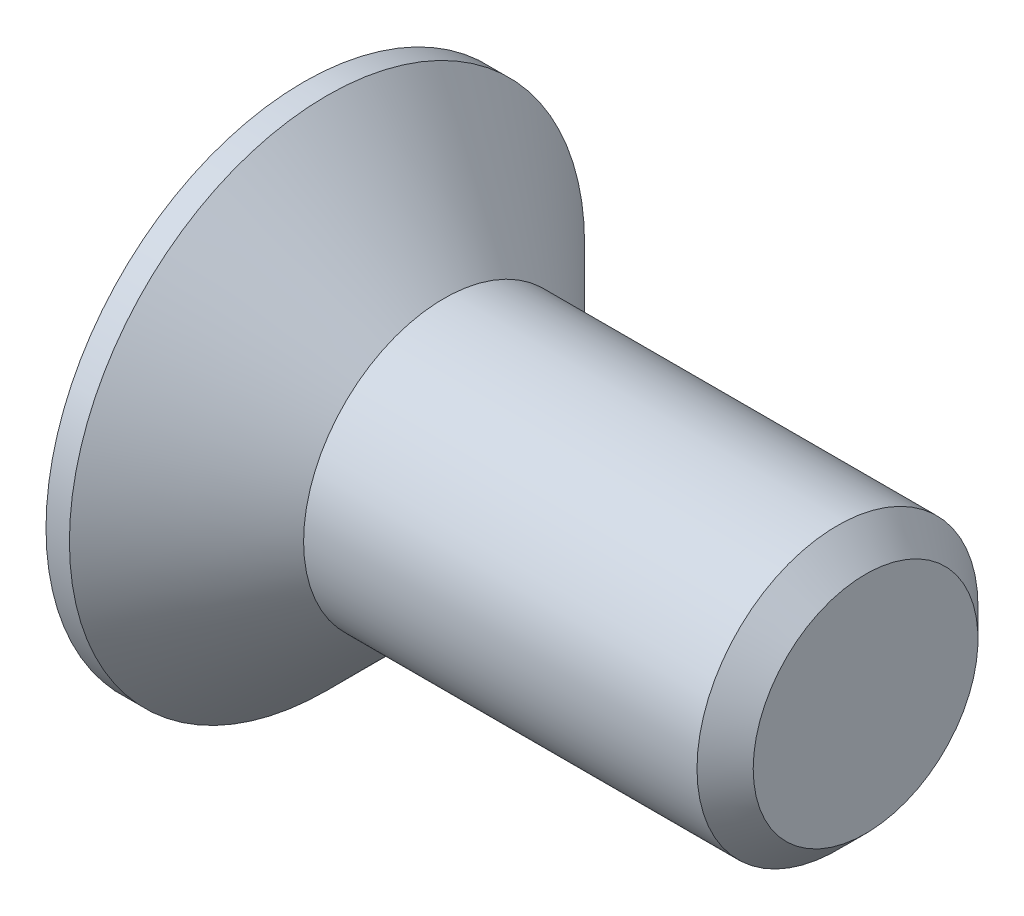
ISO-10303-21;
HEADER;
FILE_DESCRIPTION(('STEP AP214'),'2;1');
FILE_NAME('part.step','',(''),(''),'','','');
FILE_SCHEMA(('AUTOMOTIVE_DESIGN { 1 0 10303 214 1 1 1 1 }'));
ENDSEC;
DATA;
#1=APPLICATION_CONTEXT('core data for automotive mechanical design processes');
#2=APPLICATION_PROTOCOL_DEFINITION('international standard','automotive_design',2000,#1);
#3=PRODUCT_CONTEXT('',#1,'mechanical');
#4=PRODUCT('Part','Part','',(#3));
#5=PRODUCT_RELATED_PRODUCT_CATEGORY('part','',(#4));
#6=PRODUCT_DEFINITION_FORMATION('','',#4);
#7=PRODUCT_DEFINITION_CONTEXT('part definition',#1,'design');
#8=PRODUCT_DEFINITION('design','',#6,#7);
#9=PRODUCT_DEFINITION_SHAPE('','',#8);
#10=(LENGTH_UNIT() NAMED_UNIT(*) SI_UNIT(.MILLI.,.METRE.));
#11=(NAMED_UNIT(*) PLANE_ANGLE_UNIT() SI_UNIT($,.RADIAN.));
#12=(NAMED_UNIT(*) SI_UNIT($,.STERADIAN.) SOLID_ANGLE_UNIT());
#13=UNCERTAINTY_MEASURE_WITH_UNIT(LENGTH_MEASURE(1.E-05),#10,'distance_accuracy_value','');
#14=(GEOMETRIC_REPRESENTATION_CONTEXT(3) GLOBAL_UNCERTAINTY_ASSIGNED_CONTEXT((#13)) GLOBAL_UNIT_ASSIGNED_CONTEXT((#10,
#11,#12)) REPRESENTATION_CONTEXT('',''));
#15=CARTESIAN_POINT('',(0.,0.,0.));
#16=DIRECTION('',(0.,0.,1.));
#17=DIRECTION('',(1.,0.,0.));
#18=AXIS2_PLACEMENT_3D('',#15,#16,#17);
#19=CARTESIAN_POINT('',(0.,0.,0.));
#20=DIRECTION('',(-1.,0.,0.));
#21=DIRECTION('',(0.,0.,1.));
#22=AXIS2_PLACEMENT_3D('',#19,#20,#21);
#23=CONICAL_SURFACE('',#22,3.,0.78539816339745);
#24=CARTESIAN_POINT('',(-2.49999999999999,0.,0.));
#25=DIRECTION('',(-1.,0.,0.));
#26=DIRECTION('',(0.,0.,1.));
#27=AXIS2_PLACEMENT_3D('',#24,#25,#26);
#28=CIRCLE('',#27,5.5);
#29=CARTESIAN_POINT('',(-2.49999999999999,0.,5.5));
#30=VERTEX_POINT('',#29);
#31=EDGE_CURVE('E189',#30,#30,#28,.T.);
#32=ORIENTED_EDGE('',*,*,#31,.F.);
#33=EDGE_LOOP('',(#32));
#34=FACE_BOUND('',#33,.T.);
#35=CARTESIAN_POINT('',(0.,0.,0.));
#36=DIRECTION('',(-1.,0.,0.));
#37=DIRECTION('',(0.,0.,1.));
#38=AXIS2_PLACEMENT_3D('',#35,#36,#37);
#39=CIRCLE('',#38,3.);
#40=CARTESIAN_POINT('',(0.,0.,3.));
#41=VERTEX_POINT('',#40);
#42=EDGE_CURVE('E212',#41,#41,#39,.T.);
#43=ORIENTED_EDGE('',*,*,#42,.T.);
#44=EDGE_LOOP('',(#43));
#45=FACE_BOUND('',#44,.T.);
#46=ADVANCED_FACE('F33',(#34,#45),#23,.T.);
#47=CARTESIAN_POINT('',(-3.,0.,0.));
#48=DIRECTION('',(-1.,0.,0.));
#49=DIRECTION('',(0.,0.,1.));
#50=AXIS2_PLACEMENT_3D('',#47,#48,#49);
#51=CYLINDRICAL_SURFACE('',#50,3.);
#52=CARTESIAN_POINT('',(8.4,0.,0.));
#53=DIRECTION('',(-1.,0.,0.));
#54=DIRECTION('',(0.,0.,1.));
#55=AXIS2_PLACEMENT_3D('',#52,#53,#54);
#56=CIRCLE('',#55,3.);
#57=CARTESIAN_POINT('',(8.4,0.,3.));
#58=VERTEX_POINT('',#57);
#59=EDGE_CURVE('E41',#58,#58,#56,.T.);
#60=ORIENTED_EDGE('',*,*,#59,.T.);
#61=EDGE_LOOP('',(#60));
#62=FACE_BOUND('',#61,.T.);
#63=ORIENTED_EDGE('',*,*,#42,.F.);
#64=EDGE_LOOP('',(#63));
#65=FACE_BOUND('',#64,.T.);
#66=ADVANCED_FACE('F217',(#62,#65),#51,.T.);
#67=CARTESIAN_POINT('',(9.,0.,0.));
#68=DIRECTION('',(-1.,0.,0.));
#69=DIRECTION('',(0.,0.,1.));
#70=AXIS2_PLACEMENT_3D('',#67,#68,#69);
#71=PLANE('',#70);
#72=CARTESIAN_POINT('',(9.,0.,0.));
#73=DIRECTION('',(-1.,0.,0.));
#74=DIRECTION('',(0.,0.,1.));
#75=AXIS2_PLACEMENT_3D('',#72,#73,#74);
#76=CIRCLE('',#75,2.4);
#77=CARTESIAN_POINT('',(9.,0.,2.4));
#78=VERTEX_POINT('',#77);
#79=EDGE_CURVE('E11',#78,#78,#76,.F.);
#80=ORIENTED_EDGE('',*,*,#79,.T.);
#81=EDGE_LOOP('',(#80));
#82=FACE_BOUND('',#81,.T.);
#83=ADVANCED_FACE('F239',(#82),#71,.F.);
#84=CARTESIAN_POINT('',(-3.,5.5,0.));
#85=DIRECTION('',(1.,0.,0.));
#86=DIRECTION('',(0.,0.,-1.));
#87=AXIS2_PLACEMENT_3D('',#84,#85,#86);
#88=PLANE('',#87);
#89=DIRECTION('',(0.,0.,-1.));
#90=VECTOR('',#89,1.);
#91=CARTESIAN_POINT('',(-3.,0.825,-3.3));
#92=LINE('',#91,#90);
#93=CARTESIAN_POINT('',(-3.,0.825,-0.825));
#94=VERTEX_POINT('',#93);
#95=CARTESIAN_POINT('',(-3.,0.825,-3.3));
#96=VERTEX_POINT('',#95);
#97=EDGE_CURVE('E158',#94,#96,#92,.T.);
#98=ORIENTED_EDGE('',*,*,#97,.F.);
#99=DIRECTION('',(0.,-1.,0.));
#100=VECTOR('',#99,1.);
#101=CARTESIAN_POINT('',(-3.,0.825,-0.825));
#102=LINE('',#101,#100);
#103=CARTESIAN_POINT('',(-3.,3.3,-0.825));
#104=VERTEX_POINT('',#103);
#105=EDGE_CURVE('E48',#104,#94,#102,.T.);
#106=ORIENTED_EDGE('',*,*,#105,.F.);
#107=DIRECTION('',(0.,0.,-1.));
#108=VECTOR('',#107,1.);
#109=CARTESIAN_POINT('',(-3.,3.3,-0.825));
#110=LINE('',#109,#108);
#111=CARTESIAN_POINT('',(-3.,3.3,0.825));
#112=VERTEX_POINT('',#111);
#113=EDGE_CURVE('E185',#112,#104,#110,.T.);
#114=ORIENTED_EDGE('',*,*,#113,.F.);
#115=DIRECTION('',(0.,1.,0.));
#116=VECTOR('',#115,1.);
#117=CARTESIAN_POINT('',(-3.,3.3,0.825));
#118=LINE('',#117,#116);
#119=CARTESIAN_POINT('',(-3.,0.825,0.825));
#120=VERTEX_POINT('',#119);
#121=EDGE_CURVE('E183',#120,#112,#118,.T.);
#122=ORIENTED_EDGE('',*,*,#121,.F.);
#123=DIRECTION('',(0.,0.,-1.));
#124=VECTOR('',#123,1.);
#125=CARTESIAN_POINT('',(-3.,0.825,0.825));
#126=LINE('',#125,#124);
#127=CARTESIAN_POINT('',(-3.,0.825,3.3));
#128=VERTEX_POINT('',#127);
#129=EDGE_CURVE('E132',#128,#120,#126,.T.);
#130=ORIENTED_EDGE('',*,*,#129,.F.);
#131=DIRECTION('',(0.,1.,0.));
#132=VECTOR('',#131,1.);
#133=CARTESIAN_POINT('',(-3.,0.825,3.3));
#134=LINE('',#133,#132);
#135=CARTESIAN_POINT('',(-3.,-0.825,3.3));
#136=VERTEX_POINT('',#135);
#137=EDGE_CURVE('E179',#136,#128,#134,.T.);
#138=ORIENTED_EDGE('',*,*,#137,.F.);
#139=DIRECTION('',(0.,0.,1.));
#140=VECTOR('',#139,1.);
#141=CARTESIAN_POINT('',(-3.,-0.825,3.3));
#142=LINE('',#141,#140);
#143=CARTESIAN_POINT('',(-3.,-0.825,0.825));
#144=VERTEX_POINT('',#143);
#145=EDGE_CURVE('E176',#144,#136,#142,.T.);
#146=ORIENTED_EDGE('',*,*,#145,.F.);
#147=DIRECTION('',(0.,1.,0.));
#148=VECTOR('',#147,1.);
#149=CARTESIAN_POINT('',(-3.,-0.825,0.825));
#150=LINE('',#149,#148);
#151=CARTESIAN_POINT('',(-3.,-3.3,0.825));
#152=VERTEX_POINT('',#151);
#153=EDGE_CURVE('E173',#152,#144,#150,.T.);
#154=ORIENTED_EDGE('',*,*,#153,.F.);
#155=DIRECTION('',(0.,0.,1.));
#156=VECTOR('',#155,1.);
#157=CARTESIAN_POINT('',(-3.,-3.3,0.825));
#158=LINE('',#157,#156);
#159=CARTESIAN_POINT('',(-3.,-3.3,-0.825));
#160=VERTEX_POINT('',#159);
#161=EDGE_CURVE('E170',#160,#152,#158,.T.);
#162=ORIENTED_EDGE('',*,*,#161,.F.);
#163=DIRECTION('',(0.,-1.,0.));
#164=VECTOR('',#163,1.);
#165=CARTESIAN_POINT('',(-3.,-3.3,-0.825));
#166=LINE('',#165,#164);
#167=CARTESIAN_POINT('',(-3.,-0.825,-0.825));
#168=VERTEX_POINT('',#167);
#169=EDGE_CURVE('E167',#168,#160,#166,.T.);
#170=ORIENTED_EDGE('',*,*,#169,.F.);
#171=DIRECTION('',(0.,0.,1.));
#172=VECTOR('',#171,1.);
#173=CARTESIAN_POINT('',(-3.,-0.825,-0.825));
#174=LINE('',#173,#172);
#175=CARTESIAN_POINT('',(-3.,-0.825,-3.3));
#176=VERTEX_POINT('',#175);
#177=EDGE_CURVE('E164',#176,#168,#174,.T.);
#178=ORIENTED_EDGE('',*,*,#177,.F.);
#179=DIRECTION('',(0.,-1.,0.));
#180=VECTOR('',#179,1.);
#181=CARTESIAN_POINT('',(-3.,-0.825,-3.3));
#182=LINE('',#181,#180);
#183=EDGE_CURVE('E161',#96,#176,#182,.T.);
#184=ORIENTED_EDGE('',*,*,#183,.F.);
#185=EDGE_LOOP('',(#98,#106,#114,#122,#130,#138,#146,#154,#162,#170,#178,#184));
#186=FACE_BOUND('',#185,.T.);
#187=CARTESIAN_POINT('',(-3.,0.,0.));
#188=DIRECTION('',(-1.,0.,0.));
#189=DIRECTION('',(0.,0.,1.));
#190=AXIS2_PLACEMENT_3D('',#187,#188,#189);
#191=CIRCLE('',#190,5.5);
#192=CARTESIAN_POINT('',(-3.,0.,5.5));
#193=VERTEX_POINT('',#192);
#194=EDGE_CURVE('E209',#193,#193,#191,.T.);
#195=ORIENTED_EDGE('',*,*,#194,.T.);
#196=EDGE_LOOP('',(#195));
#197=FACE_BOUND('',#196,.T.);
#198=ADVANCED_FACE('F230',(#186,#197),#88,.F.);
#199=CARTESIAN_POINT('',(-3.,0.,0.));
#200=DIRECTION('',(-1.,0.,0.));
#201=DIRECTION('',(0.,0.,1.));
#202=AXIS2_PLACEMENT_3D('',#199,#200,#201);
#203=CYLINDRICAL_SURFACE('',#202,5.5);
#204=ORIENTED_EDGE('',*,*,#194,.F.);
#205=EDGE_LOOP('',(#204));
#206=FACE_BOUND('',#205,.T.);
#207=ORIENTED_EDGE('',*,*,#31,.T.);
#208=EDGE_LOOP('',(#207));
#209=FACE_BOUND('',#208,.T.);
#210=ADVANCED_FACE('F222',(#206,#209),#203,.T.);
#211=CARTESIAN_POINT('',(8.4,0.,0.));
#212=DIRECTION('',(-1.,0.,0.));
#213=DIRECTION('',(0.,0.,1.));
#214=AXIS2_PLACEMENT_3D('',#211,#212,#213);
#215=CONICAL_SURFACE('',#214,3.,0.78539816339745);
#216=ORIENTED_EDGE('',*,*,#79,.F.);
#217=EDGE_LOOP('',(#216));
#218=FACE_BOUND('',#217,.T.);
#219=ORIENTED_EDGE('',*,*,#59,.F.);
#220=EDGE_LOOP('',(#219));
#221=FACE_BOUND('',#220,.T.);
#222=ADVANCED_FACE('F35',(#218,#221),#215,.T.);
#223=CARTESIAN_POINT('',(-0.5,0.825,-0.825));
#224=DIRECTION('',(0.,0.,-1.));
#225=DIRECTION('',(-1.,0.,0.));
#226=AXIS2_PLACEMENT_3D('',#223,#224,#225);
#227=PLANE('',#226);
#228=ORIENTED_EDGE('',*,*,#105,.T.);
#229=DIRECTION('',(-1.,0.,0.));
#230=VECTOR('',#229,1.);
#231=CARTESIAN_POINT('',(-0.5,0.825,-0.825));
#232=LINE('',#231,#230);
#233=CARTESIAN_POINT('',(-0.5,0.825,-0.825));
#234=VERTEX_POINT('',#233);
#235=EDGE_CURVE('E96',#234,#94,#232,.T.);
#236=ORIENTED_EDGE('',*,*,#235,.F.);
#237=DIRECTION('',(0.,-1.,0.));
#238=VECTOR('',#237,1.);
#239=CARTESIAN_POINT('',(-0.5,0.825,-0.825));
#240=LINE('',#239,#238);
#241=CARTESIAN_POINT('',(-0.5,3.3,-0.825));
#242=VERTEX_POINT('',#241);
#243=EDGE_CURVE('E187',#242,#234,#240,.T.);
#244=ORIENTED_EDGE('',*,*,#243,.F.);
#245=DIRECTION('',(-1.,0.,0.));
#246=VECTOR('',#245,1.);
#247=CARTESIAN_POINT('',(-0.5,3.3,-0.825));
#248=LINE('',#247,#246);
#249=EDGE_CURVE('E56',#242,#104,#248,.T.);
#250=ORIENTED_EDGE('',*,*,#249,.T.);
#251=EDGE_LOOP('',(#228,#236,#244,#250));
#252=FACE_BOUND('',#251,.T.);
#253=ADVANCED_FACE('F221',(#252),#227,.F.);
#254=CARTESIAN_POINT('',(-0.5,3.3,-0.825));
#255=DIRECTION('',(0.,1.,0.));
#256=DIRECTION('',(-1.,0.,0.));
#257=AXIS2_PLACEMENT_3D('',#254,#255,#256);
#258=PLANE('',#257);
#259=ORIENTED_EDGE('',*,*,#113,.T.);
#260=ORIENTED_EDGE('',*,*,#249,.F.);
#261=DIRECTION('',(0.,0.,-1.));
#262=VECTOR('',#261,1.);
#263=CARTESIAN_POINT('',(-0.5,3.3,-0.825));
#264=LINE('',#263,#262);
#265=CARTESIAN_POINT('',(-0.5,3.3,0.825));
#266=VERTEX_POINT('',#265);
#267=EDGE_CURVE('E144',#266,#242,#264,.T.);
#268=ORIENTED_EDGE('',*,*,#267,.F.);
#269=DIRECTION('',(-1.,0.,0.));
#270=VECTOR('',#269,1.);
#271=CARTESIAN_POINT('',(-0.5,3.3,0.825));
#272=LINE('',#271,#270);
#273=EDGE_CURVE('E136',#266,#112,#272,.T.);
#274=ORIENTED_EDGE('',*,*,#273,.T.);
#275=EDGE_LOOP('',(#259,#260,#268,#274));
#276=FACE_BOUND('',#275,.T.);
#277=ADVANCED_FACE('F228',(#276),#258,.F.);
#278=CARTESIAN_POINT('',(-0.5,3.3,0.825));
#279=DIRECTION('',(0.,0.,1.));
#280=DIRECTION('',(1.,0.,0.));
#281=AXIS2_PLACEMENT_3D('',#278,#279,#280);
#282=PLANE('',#281);
#283=ORIENTED_EDGE('',*,*,#121,.T.);
#284=ORIENTED_EDGE('',*,*,#273,.F.);
#285=DIRECTION('',(0.,1.,0.));
#286=VECTOR('',#285,1.);
#287=CARTESIAN_POINT('',(-0.5,3.3,0.825));
#288=LINE('',#287,#286);
#289=CARTESIAN_POINT('',(-0.5,0.825,0.825));
#290=VERTEX_POINT('',#289);
#291=EDGE_CURVE('E140',#290,#266,#288,.T.);
#292=ORIENTED_EDGE('',*,*,#291,.F.);
#293=DIRECTION('',(-1.,0.,0.));
#294=VECTOR('',#293,1.);
#295=CARTESIAN_POINT('',(-0.5,0.825,0.825));
#296=LINE('',#295,#294);
#297=EDGE_CURVE('E125',#290,#120,#296,.T.);
#298=ORIENTED_EDGE('',*,*,#297,.T.);
#299=EDGE_LOOP('',(#283,#284,#292,#298));
#300=FACE_BOUND('',#299,.T.);
#301=ADVANCED_FACE('F141',(#300),#282,.F.);
#302=CARTESIAN_POINT('',(-0.5,0.825,0.825));
#303=DIRECTION('',(0.,1.,0.));
#304=DIRECTION('',(-1.,0.,0.));
#305=AXIS2_PLACEMENT_3D('',#302,#303,#304);
#306=PLANE('',#305);
#307=ORIENTED_EDGE('',*,*,#129,.T.);
#308=ORIENTED_EDGE('',*,*,#297,.F.);
#309=DIRECTION('',(0.,0.,-1.));
#310=VECTOR('',#309,1.);
#311=CARTESIAN_POINT('',(-0.5,0.825,0.825));
#312=LINE('',#311,#310);
#313=CARTESIAN_POINT('',(-0.5,0.825,3.3));
#314=VERTEX_POINT('',#313);
#315=EDGE_CURVE('E129',#314,#290,#312,.T.);
#316=ORIENTED_EDGE('',*,*,#315,.F.);
#317=DIRECTION('',(-1.,0.,0.));
#318=VECTOR('',#317,1.);
#319=CARTESIAN_POINT('',(-0.5,0.825,3.3));
#320=LINE('',#319,#318);
#321=EDGE_CURVE('E137',#314,#128,#320,.T.);
#322=ORIENTED_EDGE('',*,*,#321,.T.);
#323=EDGE_LOOP('',(#307,#308,#316,#322));
#324=FACE_BOUND('',#323,.T.);
#325=ADVANCED_FACE('F127',(#324),#306,.F.);
#326=CARTESIAN_POINT('',(-0.5,0.825,3.3));
#327=DIRECTION('',(0.,0.,1.));
#328=DIRECTION('',(1.,0.,0.));
#329=AXIS2_PLACEMENT_3D('',#326,#327,#328);
#330=PLANE('',#329);
#331=ORIENTED_EDGE('',*,*,#137,.T.);
#332=ORIENTED_EDGE('',*,*,#321,.F.);
#333=DIRECTION('',(0.,1.,0.));
#334=VECTOR('',#333,1.);
#335=CARTESIAN_POINT('',(-0.5,0.825,3.3));
#336=LINE('',#335,#334);
#337=CARTESIAN_POINT('',(-0.5,-0.825,3.3));
#338=VERTEX_POINT('',#337);
#339=EDGE_CURVE('E150',#338,#314,#336,.T.);
#340=ORIENTED_EDGE('',*,*,#339,.F.);
#341=DIRECTION('',(-1.,0.,0.));
#342=VECTOR('',#341,1.);
#343=CARTESIAN_POINT('',(-0.5,-0.825,3.3));
#344=LINE('',#343,#342);
#345=EDGE_CURVE('E192',#338,#136,#344,.T.);
#346=ORIENTED_EDGE('',*,*,#345,.T.);
#347=EDGE_LOOP('',(#331,#332,#340,#346));
#348=FACE_BOUND('',#347,.T.);
#349=ADVANCED_FACE('F277',(#348),#330,.F.);
#350=CARTESIAN_POINT('',(-0.5,-0.825,3.3));
#351=DIRECTION('',(0.,-1.,0.));
#352=DIRECTION('',(1.,0.,0.));
#353=AXIS2_PLACEMENT_3D('',#350,#351,#352);
#354=PLANE('',#353);
#355=ORIENTED_EDGE('',*,*,#145,.T.);
#356=ORIENTED_EDGE('',*,*,#345,.F.);
#357=DIRECTION('',(0.,0.,1.));
#358=VECTOR('',#357,1.);
#359=CARTESIAN_POINT('',(-0.5,-0.825,3.3));
#360=LINE('',#359,#358);
#361=CARTESIAN_POINT('',(-0.5,-0.825,0.825));
#362=VERTEX_POINT('',#361);
#363=EDGE_CURVE('E152',#362,#338,#360,.T.);
#364=ORIENTED_EDGE('',*,*,#363,.F.);
#365=DIRECTION('',(-1.,0.,0.));
#366=VECTOR('',#365,1.);
#367=CARTESIAN_POINT('',(-0.5,-0.825,0.825));
#368=LINE('',#367,#366);
#369=EDGE_CURVE('E194',#362,#144,#368,.T.);
#370=ORIENTED_EDGE('',*,*,#369,.T.);
#371=EDGE_LOOP('',(#355,#356,#364,#370));
#372=FACE_BOUND('',#371,.T.);
#373=ADVANCED_FACE('F273',(#372),#354,.F.);
#374=CARTESIAN_POINT('',(-0.5,-0.825,0.825));
#375=DIRECTION('',(0.,0.,1.));
#376=DIRECTION('',(1.,0.,0.));
#377=AXIS2_PLACEMENT_3D('',#374,#375,#376);
#378=PLANE('',#377);
#379=ORIENTED_EDGE('',*,*,#153,.T.);
#380=ORIENTED_EDGE('',*,*,#369,.F.);
#381=DIRECTION('',(0.,1.,0.));
#382=VECTOR('',#381,1.);
#383=CARTESIAN_POINT('',(-0.5,-0.825,0.825));
#384=LINE('',#383,#382);
#385=CARTESIAN_POINT('',(-0.5,-3.3,0.825));
#386=VERTEX_POINT('',#385);
#387=EDGE_CURVE('E422',#386,#362,#384,.T.);
#388=ORIENTED_EDGE('',*,*,#387,.F.);
#389=DIRECTION('',(-1.,0.,0.));
#390=VECTOR('',#389,1.);
#391=CARTESIAN_POINT('',(-0.5,-3.3,0.825));
#392=LINE('',#391,#390);
#393=EDGE_CURVE('E196',#386,#152,#392,.T.);
#394=ORIENTED_EDGE('',*,*,#393,.T.);
#395=EDGE_LOOP('',(#379,#380,#388,#394));
#396=FACE_BOUND('',#395,.T.);
#397=ADVANCED_FACE('F269',(#396),#378,.F.);
#398=CARTESIAN_POINT('',(-0.5,-3.3,0.825));
#399=DIRECTION('',(0.,-1.,0.));
#400=DIRECTION('',(1.,0.,0.));
#401=AXIS2_PLACEMENT_3D('',#398,#399,#400);
#402=PLANE('',#401);
#403=ORIENTED_EDGE('',*,*,#161,.T.);
#404=ORIENTED_EDGE('',*,*,#393,.F.);
#405=DIRECTION('',(0.,0.,1.));
#406=VECTOR('',#405,1.);
#407=CARTESIAN_POINT('',(-0.5,-3.3,0.825));
#408=LINE('',#407,#406);
#409=CARTESIAN_POINT('',(-0.5,-3.3,-0.825));
#410=VERTEX_POINT('',#409);
#411=EDGE_CURVE('E419',#410,#386,#408,.T.);
#412=ORIENTED_EDGE('',*,*,#411,.F.);
#413=DIRECTION('',(-1.,0.,0.));
#414=VECTOR('',#413,1.);
#415=CARTESIAN_POINT('',(-0.5,-3.3,-0.825));
#416=LINE('',#415,#414);
#417=EDGE_CURVE('E198',#410,#160,#416,.T.);
#418=ORIENTED_EDGE('',*,*,#417,.T.);
#419=EDGE_LOOP('',(#403,#404,#412,#418));
#420=FACE_BOUND('',#419,.T.);
#421=ADVANCED_FACE('F265',(#420),#402,.F.);
#422=CARTESIAN_POINT('',(-0.5,-3.3,-0.825));
#423=DIRECTION('',(0.,0.,-1.));
#424=DIRECTION('',(-1.,0.,0.));
#425=AXIS2_PLACEMENT_3D('',#422,#423,#424);
#426=PLANE('',#425);
#427=ORIENTED_EDGE('',*,*,#169,.T.);
#428=ORIENTED_EDGE('',*,*,#417,.F.);
#429=DIRECTION('',(0.,-1.,0.));
#430=VECTOR('',#429,1.);
#431=CARTESIAN_POINT('',(-0.5,-3.3,-0.825));
#432=LINE('',#431,#430);
#433=CARTESIAN_POINT('',(-0.5,-0.825,-0.825));
#434=VERTEX_POINT('',#433);
#435=EDGE_CURVE('E416',#434,#410,#432,.T.);
#436=ORIENTED_EDGE('',*,*,#435,.F.);
#437=DIRECTION('',(-1.,0.,0.));
#438=VECTOR('',#437,1.);
#439=CARTESIAN_POINT('',(-0.5,-0.825,-0.825));
#440=LINE('',#439,#438);
#441=EDGE_CURVE('E200',#434,#168,#440,.T.);
#442=ORIENTED_EDGE('',*,*,#441,.T.);
#443=EDGE_LOOP('',(#427,#428,#436,#442));
#444=FACE_BOUND('',#443,.T.);
#445=ADVANCED_FACE('F261',(#444),#426,.F.);
#446=CARTESIAN_POINT('',(-0.5,-0.825,-0.825));
#447=DIRECTION('',(0.,-1.,0.));
#448=DIRECTION('',(1.,0.,0.));
#449=AXIS2_PLACEMENT_3D('',#446,#447,#448);
#450=PLANE('',#449);
#451=ORIENTED_EDGE('',*,*,#177,.T.);
#452=ORIENTED_EDGE('',*,*,#441,.F.);
#453=DIRECTION('',(0.,0.,1.));
#454=VECTOR('',#453,1.);
#455=CARTESIAN_POINT('',(-0.5,-0.825,-0.825));
#456=LINE('',#455,#454);
#457=CARTESIAN_POINT('',(-0.5,-0.825,-3.3));
#458=VERTEX_POINT('',#457);
#459=EDGE_CURVE('E413',#458,#434,#456,.T.);
#460=ORIENTED_EDGE('',*,*,#459,.F.);
#461=DIRECTION('',(-1.,0.,0.));
#462=VECTOR('',#461,1.);
#463=CARTESIAN_POINT('',(-0.5,-0.825,-3.3));
#464=LINE('',#463,#462);
#465=EDGE_CURVE('E202',#458,#176,#464,.T.);
#466=ORIENTED_EDGE('',*,*,#465,.T.);
#467=EDGE_LOOP('',(#451,#452,#460,#466));
#468=FACE_BOUND('',#467,.T.);
#469=ADVANCED_FACE('F257',(#468),#450,.F.);
#470=CARTESIAN_POINT('',(-0.5,-0.825,-3.3));
#471=DIRECTION('',(0.,0.,-1.));
#472=DIRECTION('',(-1.,0.,0.));
#473=AXIS2_PLACEMENT_3D('',#470,#471,#472);
#474=PLANE('',#473);
#475=ORIENTED_EDGE('',*,*,#183,.T.);
#476=ORIENTED_EDGE('',*,*,#465,.F.);
#477=DIRECTION('',(0.,-1.,0.));
#478=VECTOR('',#477,1.);
#479=CARTESIAN_POINT('',(-0.5,-0.825,-3.3));
#480=LINE('',#479,#478);
#481=CARTESIAN_POINT('',(-0.5,0.825,-3.3));
#482=VERTEX_POINT('',#481);
#483=EDGE_CURVE('E408',#482,#458,#480,.T.);
#484=ORIENTED_EDGE('',*,*,#483,.F.);
#485=DIRECTION('',(-1.,0.,0.));
#486=VECTOR('',#485,1.);
#487=CARTESIAN_POINT('',(-0.5,0.825,-3.3));
#488=LINE('',#487,#486);
#489=EDGE_CURVE('E204',#482,#96,#488,.T.);
#490=ORIENTED_EDGE('',*,*,#489,.T.);
#491=EDGE_LOOP('',(#475,#476,#484,#490));
#492=FACE_BOUND('',#491,.T.);
#493=ADVANCED_FACE('F253',(#492),#474,.F.);
#494=CARTESIAN_POINT('',(-0.5,0.825,-3.3));
#495=DIRECTION('',(0.,1.,0.));
#496=DIRECTION('',(-1.,0.,0.));
#497=AXIS2_PLACEMENT_3D('',#494,#495,#496);
#498=PLANE('',#497);
#499=ORIENTED_EDGE('',*,*,#97,.T.);
#500=ORIENTED_EDGE('',*,*,#489,.F.);
#501=DIRECTION('',(0.,0.,-1.));
#502=VECTOR('',#501,1.);
#503=CARTESIAN_POINT('',(-0.5,0.825,-3.3));
#504=LINE('',#503,#502);
#505=EDGE_CURVE('E406',#234,#482,#504,.T.);
#506=ORIENTED_EDGE('',*,*,#505,.F.);
#507=ORIENTED_EDGE('',*,*,#235,.T.);
#508=EDGE_LOOP('',(#499,#500,#506,#507));
#509=FACE_BOUND('',#508,.T.);
#510=ADVANCED_FACE('F250',(#509),#498,.F.);
#511=CARTESIAN_POINT('',(-0.5,0.,0.));
#512=DIRECTION('',(1.,0.,0.));
#513=DIRECTION('',(0.,0.,-1.));
#514=AXIS2_PLACEMENT_3D('',#511,#512,#513);
#515=PLANE('',#514);
#516=ORIENTED_EDGE('',*,*,#243,.T.);
#517=ORIENTED_EDGE('',*,*,#505,.T.);
#518=ORIENTED_EDGE('',*,*,#483,.T.);
#519=ORIENTED_EDGE('',*,*,#459,.T.);
#520=ORIENTED_EDGE('',*,*,#435,.T.);
#521=ORIENTED_EDGE('',*,*,#411,.T.);
#522=ORIENTED_EDGE('',*,*,#387,.T.);
#523=ORIENTED_EDGE('',*,*,#363,.T.);
#524=ORIENTED_EDGE('',*,*,#339,.T.);
#525=ORIENTED_EDGE('',*,*,#315,.T.);
#526=ORIENTED_EDGE('',*,*,#291,.T.);
#527=ORIENTED_EDGE('',*,*,#267,.T.);
#528=EDGE_LOOP('',(#516,#517,#518,#519,#520,#521,#522,#523,#524,#525,#526,#527));
#529=FACE_BOUND('',#528,.T.);
#530=ADVANCED_FACE('F147',(#529),#515,.F.);
#531=CLOSED_SHELL('',(#46,#66,#83,#198,#210,#222,#253,#277,#301,#325,#349,#373,#397,#421,#445,
#469,#493,#510,#530));
#532=MANIFOLD_SOLID_BREP('B2',#531);
#533=ADVANCED_BREP_SHAPE_REPRESENTATION('',(#18,#532),#14);
#534=SHAPE_DEFINITION_REPRESENTATION(#9,#533);
ENDSEC;
END-ISO-10303-21;
